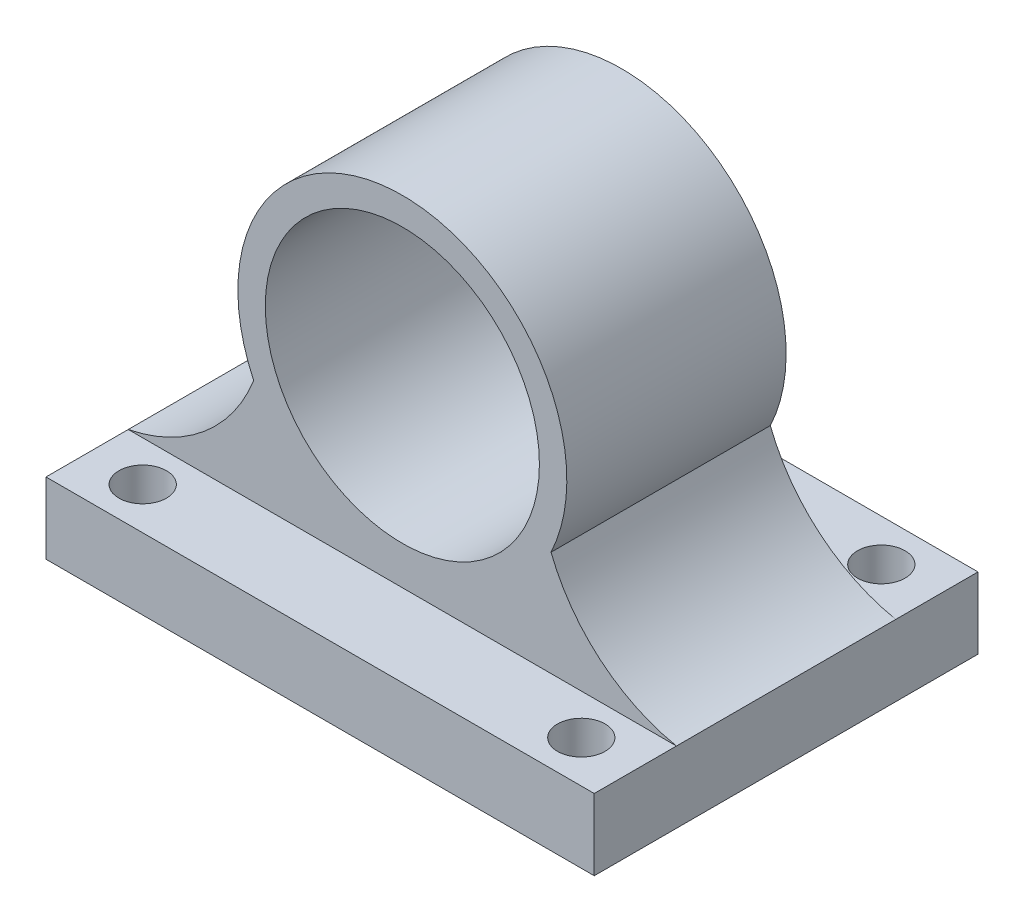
ISO-10303-21;
HEADER;
FILE_DESCRIPTION(('STEP AP214'),'2;1');
FILE_NAME('part.step','',(''),(''),'','','');
FILE_SCHEMA(('AUTOMOTIVE_DESIGN { 1 0 10303 214 1 1 1 1 }'));
ENDSEC;
DATA;
#1=APPLICATION_CONTEXT('core data for automotive mechanical design processes');
#2=APPLICATION_PROTOCOL_DEFINITION('international standard','automotive_design',2000,#1);
#3=PRODUCT_CONTEXT('',#1,'mechanical');
#4=PRODUCT('Part','Part','',(#3));
#5=PRODUCT_RELATED_PRODUCT_CATEGORY('part','',(#4));
#6=PRODUCT_DEFINITION_FORMATION('','',#4);
#7=PRODUCT_DEFINITION_CONTEXT('part definition',#1,'design');
#8=PRODUCT_DEFINITION('design','',#6,#7);
#9=PRODUCT_DEFINITION_SHAPE('','',#8);
#10=(LENGTH_UNIT() NAMED_UNIT(*) SI_UNIT(.MILLI.,.METRE.));
#11=(NAMED_UNIT(*) PLANE_ANGLE_UNIT() SI_UNIT($,.RADIAN.));
#12=(NAMED_UNIT(*) SI_UNIT($,.STERADIAN.) SOLID_ANGLE_UNIT());
#13=UNCERTAINTY_MEASURE_WITH_UNIT(LENGTH_MEASURE(1.E-05),#10,'distance_accuracy_value','');
#14=(GEOMETRIC_REPRESENTATION_CONTEXT(3) GLOBAL_UNCERTAINTY_ASSIGNED_CONTEXT((#13)) GLOBAL_UNIT_ASSIGNED_CONTEXT((#10,
#11,#12)) REPRESENTATION_CONTEXT('',''));
#15=CARTESIAN_POINT('',(0.,0.,0.));
#16=DIRECTION('',(0.,0.,1.));
#17=DIRECTION('',(1.,0.,0.));
#18=AXIS2_PLACEMENT_3D('',#15,#16,#17);
#19=CARTESIAN_POINT('',(31.75,8.255,-22.225));
#20=DIRECTION('',(0.,-1.,0.));
#21=DIRECTION('',(0.,0.,-1.));
#22=AXIS2_PLACEMENT_3D('',#19,#20,#21);
#23=PLANE('',#22);
#24=CARTESIAN_POINT('',(25.4,8.255,17.3736));
#25=DIRECTION('',(0.,-1.,0.));
#26=DIRECTION('',(0.,0.,-1.));
#27=AXIS2_PLACEMENT_3D('',#24,#25,#26);
#28=CIRCLE('',#27,2.7559);
#29=CARTESIAN_POINT('',(25.4,8.255,14.6177));
#30=VERTEX_POINT('',#29);
#31=EDGE_CURVE('E234',#30,#30,#28,.T.);
#32=ORIENTED_EDGE('',*,*,#31,.T.);
#33=EDGE_LOOP('',(#32));
#34=FACE_BOUND('',#33,.T.);
#35=CARTESIAN_POINT('',(-25.4,8.255,17.3736));
#36=DIRECTION('',(0.,-1.,0.));
#37=DIRECTION('',(0.,0.,-1.));
#38=AXIS2_PLACEMENT_3D('',#35,#36,#37);
#39=CIRCLE('',#38,2.7559);
#40=CARTESIAN_POINT('',(-25.4,8.255,14.6177));
#41=VERTEX_POINT('',#40);
#42=EDGE_CURVE('E139',#41,#41,#39,.T.);
#43=ORIENTED_EDGE('',*,*,#42,.T.);
#44=EDGE_LOOP('',(#43));
#45=FACE_BOUND('',#44,.T.);
#46=DIRECTION('',(1.,0.,0.));
#47=VECTOR('',#46,1.);
#48=CARTESIAN_POINT('',(0.,8.255,12.7));
#49=LINE('',#48,#47);
#50=CARTESIAN_POINT('',(-31.75,8.255,12.7));
#51=VERTEX_POINT('',#50);
#52=CARTESIAN_POINT('',(31.75,8.255,12.7));
#53=VERTEX_POINT('',#52);
#54=EDGE_CURVE('E160',#51,#53,#49,.T.);
#55=ORIENTED_EDGE('',*,*,#54,.F.);
#56=DIRECTION('',(0.,0.,1.));
#57=VECTOR('',#56,1.);
#58=CARTESIAN_POINT('',(-31.75,8.255,22.225));
#59=LINE('',#58,#57);
#60=CARTESIAN_POINT('',(-31.75,8.255,22.225));
#61=VERTEX_POINT('',#60);
#62=EDGE_CURVE('E196',#51,#61,#59,.T.);
#63=ORIENTED_EDGE('',*,*,#62,.T.);
#64=DIRECTION('',(1.,0.,0.));
#65=VECTOR('',#64,1.);
#66=CARTESIAN_POINT('',(-31.75,8.255,22.225));
#67=LINE('',#66,#65);
#68=CARTESIAN_POINT('',(31.75,8.255,22.225));
#69=VERTEX_POINT('',#68);
#70=EDGE_CURVE('E58',#61,#69,#67,.T.);
#71=ORIENTED_EDGE('',*,*,#70,.T.);
#72=DIRECTION('',(0.,0.,-1.));
#73=VECTOR('',#72,1.);
#74=CARTESIAN_POINT('',(31.75,8.255,22.225));
#75=LINE('',#74,#73);
#76=EDGE_CURVE('E177',#69,#53,#75,.T.);
#77=ORIENTED_EDGE('',*,*,#76,.T.);
#78=EDGE_LOOP('',(#55,#63,#71,#77));
#79=FACE_BOUND('',#78,.T.);
#80=ADVANCED_FACE('F32',(#34,#45,#79),#23,.F.);
#81=CARTESIAN_POINT('',(31.75,8.255,22.225));
#82=DIRECTION('',(-1.,0.,0.));
#83=DIRECTION('',(0.,0.,1.));
#84=AXIS2_PLACEMENT_3D('',#81,#82,#83);
#85=PLANE('',#84);
#86=DIRECTION('',(0.,0.,-1.));
#87=VECTOR('',#86,1.);
#88=CARTESIAN_POINT('',(31.75,0.,22.225));
#89=LINE('',#88,#87);
#90=CARTESIAN_POINT('',(31.75,0.,22.225));
#91=VERTEX_POINT('',#90);
#92=CARTESIAN_POINT('',(31.75,0.,-22.225));
#93=VERTEX_POINT('',#92);
#94=EDGE_CURVE('E167',#91,#93,#89,.T.);
#95=ORIENTED_EDGE('',*,*,#94,.T.);
#96=DIRECTION('',(0.,-1.,0.));
#97=VECTOR('',#96,1.);
#98=CARTESIAN_POINT('',(31.75,8.255,-22.225));
#99=LINE('',#98,#97);
#100=CARTESIAN_POINT('',(31.75,8.255,-22.225));
#101=VERTEX_POINT('',#100);
#102=EDGE_CURVE('E11',#101,#93,#99,.T.);
#103=ORIENTED_EDGE('',*,*,#102,.F.);
#104=CARTESIAN_POINT('',(31.75,8.255,-12.7));
#105=VERTEX_POINT('',#104);
#106=EDGE_CURVE('E87',#105,#101,#75,.T.);
#107=ORIENTED_EDGE('',*,*,#106,.F.);
#108=DIRECTION('',(0.,0.,1.));
#109=VECTOR('',#108,1.);
#110=CARTESIAN_POINT('',(31.75,8.255,-12.7));
#111=LINE('',#110,#109);
#112=EDGE_CURVE('E149',#105,#53,#111,.T.);
#113=ORIENTED_EDGE('',*,*,#112,.T.);
#114=ORIENTED_EDGE('',*,*,#76,.F.);
#115=DIRECTION('',(0.,-1.,0.));
#116=VECTOR('',#115,1.);
#117=CARTESIAN_POINT('',(31.75,8.255,22.225));
#118=LINE('',#117,#116);
#119=EDGE_CURVE('E183',#69,#91,#118,.T.);
#120=ORIENTED_EDGE('',*,*,#119,.T.);
#121=EDGE_LOOP('',(#95,#103,#107,#113,#114,#120));
#122=FACE_BOUND('',#121,.T.);
#123=ADVANCED_FACE('F34',(#122),#85,.F.);
#124=CARTESIAN_POINT('',(-31.75,8.255,-22.225));
#125=DIRECTION('',(0.,0.,1.));
#126=DIRECTION('',(1.,0.,0.));
#127=AXIS2_PLACEMENT_3D('',#124,#125,#126);
#128=PLANE('',#127);
#129=DIRECTION('',(-1.,0.,0.));
#130=VECTOR('',#129,1.);
#131=CARTESIAN_POINT('',(-31.75,0.,-22.225));
#132=LINE('',#131,#130);
#133=CARTESIAN_POINT('',(-31.75,0.,-22.225));
#134=VERTEX_POINT('',#133);
#135=EDGE_CURVE('E188',#93,#134,#132,.T.);
#136=ORIENTED_EDGE('',*,*,#135,.T.);
#137=DIRECTION('',(0.,-1.,0.));
#138=VECTOR('',#137,1.);
#139=CARTESIAN_POINT('',(-31.75,8.255,-22.225));
#140=LINE('',#139,#138);
#141=CARTESIAN_POINT('',(-31.75,8.255,-22.225));
#142=VERTEX_POINT('',#141);
#143=EDGE_CURVE('E41',#142,#134,#140,.T.);
#144=ORIENTED_EDGE('',*,*,#143,.F.);
#145=DIRECTION('',(-1.,0.,0.));
#146=VECTOR('',#145,1.);
#147=CARTESIAN_POINT('',(-31.75,8.255,-22.225));
#148=LINE('',#147,#146);
#149=EDGE_CURVE('E171',#101,#142,#148,.T.);
#150=ORIENTED_EDGE('',*,*,#149,.F.);
#151=ORIENTED_EDGE('',*,*,#102,.T.);
#152=EDGE_LOOP('',(#136,#144,#150,#151));
#153=FACE_BOUND('',#152,.T.);
#154=ADVANCED_FACE('F206',(#153),#128,.F.);
#155=CARTESIAN_POINT('',(-31.75,8.255,22.225));
#156=DIRECTION('',(1.,0.,0.));
#157=DIRECTION('',(0.,0.,-1.));
#158=AXIS2_PLACEMENT_3D('',#155,#156,#157);
#159=PLANE('',#158);
#160=DIRECTION('',(0.,0.,1.));
#161=VECTOR('',#160,1.);
#162=CARTESIAN_POINT('',(-31.75,0.,22.225));
#163=LINE('',#162,#161);
#164=CARTESIAN_POINT('',(-31.75,0.,22.225));
#165=VERTEX_POINT('',#164);
#166=EDGE_CURVE('E186',#134,#165,#163,.T.);
#167=ORIENTED_EDGE('',*,*,#166,.T.);
#168=DIRECTION('',(0.,-1.,0.));
#169=VECTOR('',#168,1.);
#170=CARTESIAN_POINT('',(-31.75,8.255,22.225));
#171=LINE('',#170,#169);
#172=EDGE_CURVE('E181',#61,#165,#171,.T.);
#173=ORIENTED_EDGE('',*,*,#172,.F.);
#174=ORIENTED_EDGE('',*,*,#62,.F.);
#175=DIRECTION('',(0.,0.,1.));
#176=VECTOR('',#175,1.);
#177=CARTESIAN_POINT('',(-31.75,8.255,-12.7));
#178=LINE('',#177,#176);
#179=CARTESIAN_POINT('',(-31.75,8.255,-12.7));
#180=VERTEX_POINT('',#179);
#181=EDGE_CURVE('E127',#180,#51,#178,.T.);
#182=ORIENTED_EDGE('',*,*,#181,.F.);
#183=EDGE_CURVE('E192',#142,#180,#59,.T.);
#184=ORIENTED_EDGE('',*,*,#183,.F.);
#185=ORIENTED_EDGE('',*,*,#143,.T.);
#186=EDGE_LOOP('',(#167,#173,#174,#182,#184,#185));
#187=FACE_BOUND('',#186,.T.);
#188=ADVANCED_FACE('F209',(#187),#159,.F.);
#189=CARTESIAN_POINT('',(-31.75,8.255,22.225));
#190=DIRECTION('',(0.,0.,-1.));
#191=DIRECTION('',(-1.,0.,0.));
#192=AXIS2_PLACEMENT_3D('',#189,#190,#191);
#193=PLANE('',#192);
#194=DIRECTION('',(1.,0.,0.));
#195=VECTOR('',#194,1.);
#196=CARTESIAN_POINT('',(-31.75,0.,22.225));
#197=LINE('',#196,#195);
#198=EDGE_CURVE('E79',#165,#91,#197,.T.);
#199=ORIENTED_EDGE('',*,*,#198,.T.);
#200=ORIENTED_EDGE('',*,*,#119,.F.);
#201=ORIENTED_EDGE('',*,*,#70,.F.);
#202=ORIENTED_EDGE('',*,*,#172,.T.);
#203=EDGE_LOOP('',(#199,#200,#201,#202));
#204=FACE_BOUND('',#203,.T.);
#205=ADVANCED_FACE('F259',(#204),#193,.F.);
#206=CARTESIAN_POINT('',(25.4,8.255,-17.3736));
#207=DIRECTION('',(0.,-1.,0.));
#208=DIRECTION('',(0.,0.,-1.));
#209=AXIS2_PLACEMENT_3D('',#206,#207,#208);
#210=CIRCLE('',#209,2.7559);
#211=CARTESIAN_POINT('',(25.4,8.255,-20.1295));
#212=VERTEX_POINT('',#211);
#213=EDGE_CURVE('E240',#212,#212,#210,.T.);
#214=ORIENTED_EDGE('',*,*,#213,.T.);
#215=EDGE_LOOP('',(#214));
#216=FACE_BOUND('',#215,.T.);
#217=CARTESIAN_POINT('',(-25.4,8.255,-17.3736));
#218=DIRECTION('',(0.,-1.,0.));
#219=DIRECTION('',(0.,0.,-1.));
#220=AXIS2_PLACEMENT_3D('',#217,#218,#219);
#221=CIRCLE('',#220,2.7559);
#222=CARTESIAN_POINT('',(-25.4,8.255,-20.1295));
#223=VERTEX_POINT('',#222);
#224=EDGE_CURVE('E225',#223,#223,#221,.T.);
#225=ORIENTED_EDGE('',*,*,#224,.T.);
#226=EDGE_LOOP('',(#225));
#227=FACE_BOUND('',#226,.T.);
#228=ORIENTED_EDGE('',*,*,#183,.T.);
#229=DIRECTION('',(1.,0.,0.));
#230=VECTOR('',#229,1.);
#231=CARTESIAN_POINT('',(0.,8.255,-12.7));
#232=LINE('',#231,#230);
#233=EDGE_CURVE('E115',#180,#105,#232,.T.);
#234=ORIENTED_EDGE('',*,*,#233,.T.);
#235=ORIENTED_EDGE('',*,*,#106,.T.);
#236=ORIENTED_EDGE('',*,*,#149,.T.);
#237=EDGE_LOOP('',(#228,#234,#235,#236));
#238=FACE_BOUND('',#237,.T.);
#239=ADVANCED_FACE('F203',(#216,#227,#238),#23,.F.);
#240=CARTESIAN_POINT('',(31.75,0.,-22.225));
#241=DIRECTION('',(0.,-1.,0.));
#242=DIRECTION('',(0.,0.,-1.));
#243=AXIS2_PLACEMENT_3D('',#240,#241,#242);
#244=PLANE('',#243);
#245=CARTESIAN_POINT('',(25.4,0.,-17.3736));
#246=DIRECTION('',(0.,-1.,0.));
#247=DIRECTION('',(0.,0.,-1.));
#248=AXIS2_PLACEMENT_3D('',#245,#246,#247);
#249=CIRCLE('',#248,2.7559);
#250=CARTESIAN_POINT('',(25.4,0.,-20.1295));
#251=VERTEX_POINT('',#250);
#252=EDGE_CURVE('E243',#251,#251,#249,.T.);
#253=ORIENTED_EDGE('',*,*,#252,.F.);
#254=EDGE_LOOP('',(#253));
#255=FACE_BOUND('',#254,.T.);
#256=CARTESIAN_POINT('',(25.4,0.,17.3736));
#257=DIRECTION('',(0.,-1.,0.));
#258=DIRECTION('',(0.,0.,-1.));
#259=AXIS2_PLACEMENT_3D('',#256,#257,#258);
#260=CIRCLE('',#259,2.7559);
#261=CARTESIAN_POINT('',(25.4,0.,14.6177));
#262=VERTEX_POINT('',#261);
#263=EDGE_CURVE('E237',#262,#262,#260,.T.);
#264=ORIENTED_EDGE('',*,*,#263,.F.);
#265=EDGE_LOOP('',(#264));
#266=FACE_BOUND('',#265,.T.);
#267=CARTESIAN_POINT('',(-25.4,0.,-17.3736));
#268=DIRECTION('',(0.,-1.,0.));
#269=DIRECTION('',(0.,0.,-1.));
#270=AXIS2_PLACEMENT_3D('',#267,#268,#269);
#271=CIRCLE('',#270,2.7559);
#272=CARTESIAN_POINT('',(-25.4,0.,-20.1295));
#273=VERTEX_POINT('',#272);
#274=EDGE_CURVE('E229',#273,#273,#271,.T.);
#275=ORIENTED_EDGE('',*,*,#274,.F.);
#276=EDGE_LOOP('',(#275));
#277=FACE_BOUND('',#276,.T.);
#278=CARTESIAN_POINT('',(-25.4,0.,17.3736));
#279=DIRECTION('',(0.,-1.,0.));
#280=DIRECTION('',(0.,0.,-1.));
#281=AXIS2_PLACEMENT_3D('',#278,#279,#280);
#282=CIRCLE('',#281,2.7559);
#283=CARTESIAN_POINT('',(-25.4,0.,14.6177));
#284=VERTEX_POINT('',#283);
#285=EDGE_CURVE('E221',#284,#284,#282,.T.);
#286=ORIENTED_EDGE('',*,*,#285,.F.);
#287=EDGE_LOOP('',(#286));
#288=FACE_BOUND('',#287,.T.);
#289=ORIENTED_EDGE('',*,*,#94,.F.);
#290=ORIENTED_EDGE('',*,*,#198,.F.);
#291=ORIENTED_EDGE('',*,*,#166,.F.);
#292=ORIENTED_EDGE('',*,*,#135,.F.);
#293=EDGE_LOOP('',(#289,#290,#291,#292));
#294=FACE_BOUND('',#293,.T.);
#295=ADVANCED_FACE('F250',(#255,#266,#277,#288,#294),#244,.T.);
#296=CARTESIAN_POINT('',(0.,28.575,-12.7));
#297=DIRECTION('',(0.,0.,1.));
#298=DIRECTION('',(1.,0.,0.));
#299=AXIS2_PLACEMENT_3D('',#296,#297,#298);
#300=CYLINDRICAL_SURFACE('',#299,19.05);
#301=CARTESIAN_POINT('',(0.,28.575,12.7));
#302=DIRECTION('',(0.,0.,1.));
#303=DIRECTION('',(1.,0.,0.));
#304=AXIS2_PLACEMENT_3D('',#301,#302,#303);
#305=CIRCLE('',#304,19.05);
#306=CARTESIAN_POINT('',(17.2205010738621,20.4290290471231,12.7));
#307=VERTEX_POINT('',#306);
#308=CARTESIAN_POINT('',(-17.2205010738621,20.4290290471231,12.7));
#309=VERTEX_POINT('',#308);
#310=EDGE_CURVE('E161',#307,#309,#305,.T.);
#311=ORIENTED_EDGE('',*,*,#310,.F.);
#312=DIRECTION('',(0.,0.,1.));
#313=VECTOR('',#312,1.);
#314=CARTESIAN_POINT('',(17.2205010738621,20.4290290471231,-12.7));
#315=LINE('',#314,#313);
#316=CARTESIAN_POINT('',(17.2205010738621,20.4290290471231,-12.7));
#317=VERTEX_POINT('',#316);
#318=EDGE_CURVE('E131',#317,#307,#315,.T.);
#319=ORIENTED_EDGE('',*,*,#318,.F.);
#320=CARTESIAN_POINT('',(0.,28.575,-12.7));
#321=DIRECTION('',(0.,0.,1.));
#322=DIRECTION('',(1.,0.,0.));
#323=AXIS2_PLACEMENT_3D('',#320,#321,#322);
#324=CIRCLE('',#323,19.05);
#325=CARTESIAN_POINT('',(-17.2205010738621,20.4290290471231,-12.7));
#326=VERTEX_POINT('',#325);
#327=EDGE_CURVE('E114',#317,#326,#324,.T.);
#328=ORIENTED_EDGE('',*,*,#327,.T.);
#329=DIRECTION('',(0.,0.,1.));
#330=VECTOR('',#329,1.);
#331=CARTESIAN_POINT('',(-17.2205010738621,20.4290290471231,-12.7));
#332=LINE('',#331,#330);
#333=EDGE_CURVE('E120',#326,#309,#332,.T.);
#334=ORIENTED_EDGE('',*,*,#333,.T.);
#335=EDGE_LOOP('',(#311,#319,#328,#334));
#336=FACE_BOUND('',#335,.T.);
#337=ADVANCED_FACE('F130',(#336),#300,.T.);
#338=CARTESIAN_POINT('',(35.6032850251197,27.6112017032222,-12.7));
#339=DIRECTION('',(0.,0.,1.));
#340=DIRECTION('',(1.,0.,0.));
#341=AXIS2_PLACEMENT_3D('',#338,#339,#340);
#342=CYLINDRICAL_SURFACE('',#341,19.7360165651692);
#343=CARTESIAN_POINT('',(35.6032850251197,27.6112017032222,12.7));
#344=DIRECTION('',(0.,0.,1.));
#345=DIRECTION('',(1.,0.,0.));
#346=AXIS2_PLACEMENT_3D('',#343,#344,#345);
#347=CIRCLE('',#346,19.7360165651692);
#348=EDGE_CURVE('E135',#53,#307,#347,.F.);
#349=ORIENTED_EDGE('',*,*,#348,.F.);
#350=ORIENTED_EDGE('',*,*,#112,.F.);
#351=CARTESIAN_POINT('',(35.6032850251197,27.6112017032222,-12.7));
#352=DIRECTION('',(0.,0.,1.));
#353=DIRECTION('',(1.,0.,0.));
#354=AXIS2_PLACEMENT_3D('',#351,#352,#353);
#355=CIRCLE('',#354,19.7360165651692);
#356=EDGE_CURVE('E49',#105,#317,#355,.F.);
#357=ORIENTED_EDGE('',*,*,#356,.T.);
#358=ORIENTED_EDGE('',*,*,#318,.T.);
#359=EDGE_LOOP('',(#349,#350,#357,#358));
#360=FACE_BOUND('',#359,.T.);
#361=ADVANCED_FACE('F219',(#360),#342,.F.);
#362=CARTESIAN_POINT('',(-35.6032850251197,27.6112017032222,-12.7));
#363=DIRECTION('',(0.,0.,1.));
#364=DIRECTION('',(1.,0.,0.));
#365=AXIS2_PLACEMENT_3D('',#362,#363,#364);
#366=CYLINDRICAL_SURFACE('',#365,19.7360165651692);
#367=CARTESIAN_POINT('',(-35.6032850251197,27.6112017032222,12.7));
#368=DIRECTION('',(0.,0.,1.));
#369=DIRECTION('',(1.,0.,0.));
#370=AXIS2_PLACEMENT_3D('',#367,#368,#369);
#371=CIRCLE('',#370,19.7360165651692);
#372=EDGE_CURVE('E123',#51,#309,#371,.T.);
#373=ORIENTED_EDGE('',*,*,#372,.T.);
#374=ORIENTED_EDGE('',*,*,#333,.F.);
#375=CARTESIAN_POINT('',(-35.6032850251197,27.6112017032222,-12.7));
#376=DIRECTION('',(0.,0.,1.));
#377=DIRECTION('',(1.,0.,0.));
#378=AXIS2_PLACEMENT_3D('',#375,#376,#377);
#379=CIRCLE('',#378,19.7360165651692);
#380=EDGE_CURVE('E109',#180,#326,#379,.T.);
#381=ORIENTED_EDGE('',*,*,#380,.F.);
#382=ORIENTED_EDGE('',*,*,#181,.T.);
#383=EDGE_LOOP('',(#373,#374,#381,#382));
#384=FACE_BOUND('',#383,.T.);
#385=ADVANCED_FACE('F121',(#384),#366,.F.);
#386=CARTESIAN_POINT('',(0.,28.575,-12.7));
#387=DIRECTION('',(0.,0.,1.));
#388=DIRECTION('',(1.,0.,0.));
#389=AXIS2_PLACEMENT_3D('',#386,#387,#388);
#390=CYLINDRICAL_SURFACE('',#389,15.875);
#391=CARTESIAN_POINT('',(0.,28.575,-12.7));
#392=DIRECTION('',(0.,0.,1.));
#393=DIRECTION('',(1.,0.,0.));
#394=AXIS2_PLACEMENT_3D('',#391,#392,#393);
#395=CIRCLE('',#394,15.875);
#396=CARTESIAN_POINT('',(15.875,28.575,-12.7));
#397=VERTEX_POINT('',#396);
#398=EDGE_CURVE('E128',#397,#397,#395,.T.);
#399=ORIENTED_EDGE('',*,*,#398,.F.);
#400=EDGE_LOOP('',(#399));
#401=FACE_BOUND('',#400,.T.);
#402=CARTESIAN_POINT('',(0.,28.575,12.7));
#403=DIRECTION('',(0.,0.,1.));
#404=DIRECTION('',(1.,0.,0.));
#405=AXIS2_PLACEMENT_3D('',#402,#403,#404);
#406=CIRCLE('',#405,15.875);
#407=CARTESIAN_POINT('',(15.875,28.575,12.7));
#408=VERTEX_POINT('',#407);
#409=EDGE_CURVE('E132',#408,#408,#406,.T.);
#410=ORIENTED_EDGE('',*,*,#409,.T.);
#411=EDGE_LOOP('',(#410));
#412=FACE_BOUND('',#411,.T.);
#413=ADVANCED_FACE('F281',(#401,#412),#390,.F.);
#414=CARTESIAN_POINT('',(0.,-48.6872216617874,-12.7));
#415=DIRECTION('',(0.,0.,1.));
#416=DIRECTION('',(1.,0.,0.));
#417=AXIS2_PLACEMENT_3D('',#414,#415,#416);
#418=PLANE('',#417);
#419=ORIENTED_EDGE('',*,*,#327,.F.);
#420=ORIENTED_EDGE('',*,*,#356,.F.);
#421=ORIENTED_EDGE('',*,*,#233,.F.);
#422=ORIENTED_EDGE('',*,*,#380,.T.);
#423=EDGE_LOOP('',(#419,#420,#421,#422));
#424=FACE_BOUND('',#423,.T.);
#425=ORIENTED_EDGE('',*,*,#398,.T.);
#426=EDGE_LOOP('',(#425));
#427=FACE_BOUND('',#426,.T.);
#428=ADVANCED_FACE('F111',(#424,#427),#418,.F.);
#429=CARTESIAN_POINT('',(0.,-48.6872216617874,12.7));
#430=DIRECTION('',(0.,0.,1.));
#431=DIRECTION('',(1.,0.,0.));
#432=AXIS2_PLACEMENT_3D('',#429,#430,#431);
#433=PLANE('',#432);
#434=ORIENTED_EDGE('',*,*,#310,.T.);
#435=ORIENTED_EDGE('',*,*,#372,.F.);
#436=ORIENTED_EDGE('',*,*,#54,.T.);
#437=ORIENTED_EDGE('',*,*,#348,.T.);
#438=EDGE_LOOP('',(#434,#435,#436,#437));
#439=FACE_BOUND('',#438,.T.);
#440=ORIENTED_EDGE('',*,*,#409,.F.);
#441=EDGE_LOOP('',(#440));
#442=FACE_BOUND('',#441,.T.);
#443=ADVANCED_FACE('F211',(#439,#442),#433,.T.);
#444=CARTESIAN_POINT('',(-25.4,25.4,17.3736));
#445=DIRECTION('',(0.,-1.,0.));
#446=DIRECTION('',(0.,0.,-1.));
#447=AXIS2_PLACEMENT_3D('',#444,#445,#446);
#448=CYLINDRICAL_SURFACE('',#447,2.7559);
#449=ORIENTED_EDGE('',*,*,#285,.T.);
#450=EDGE_LOOP('',(#449));
#451=FACE_BOUND('',#450,.T.);
#452=ORIENTED_EDGE('',*,*,#42,.F.);
#453=EDGE_LOOP('',(#452));
#454=FACE_BOUND('',#453,.T.);
#455=ADVANCED_FACE('F289',(#451,#454),#448,.F.);
#456=CARTESIAN_POINT('',(-25.4,25.4,-17.3736));
#457=DIRECTION('',(0.,-1.,0.));
#458=DIRECTION('',(0.,0.,-1.));
#459=AXIS2_PLACEMENT_3D('',#456,#457,#458);
#460=CYLINDRICAL_SURFACE('',#459,2.7559);
#461=ORIENTED_EDGE('',*,*,#274,.T.);
#462=EDGE_LOOP('',(#461));
#463=FACE_BOUND('',#462,.T.);
#464=ORIENTED_EDGE('',*,*,#224,.F.);
#465=EDGE_LOOP('',(#464));
#466=FACE_BOUND('',#465,.T.);
#467=ADVANCED_FACE('F294',(#463,#466),#460,.F.);
#468=CARTESIAN_POINT('',(25.4,25.4,17.3736));
#469=DIRECTION('',(0.,-1.,0.));
#470=DIRECTION('',(0.,0.,-1.));
#471=AXIS2_PLACEMENT_3D('',#468,#469,#470);
#472=CYLINDRICAL_SURFACE('',#471,2.7559);
#473=ORIENTED_EDGE('',*,*,#263,.T.);
#474=EDGE_LOOP('',(#473));
#475=FACE_BOUND('',#474,.T.);
#476=ORIENTED_EDGE('',*,*,#31,.F.);
#477=EDGE_LOOP('',(#476));
#478=FACE_BOUND('',#477,.T.);
#479=ADVANCED_FACE('F297',(#475,#478),#472,.F.);
#480=CARTESIAN_POINT('',(25.4,25.4,-17.3736));
#481=DIRECTION('',(0.,-1.,0.));
#482=DIRECTION('',(0.,0.,-1.));
#483=AXIS2_PLACEMENT_3D('',#480,#481,#482);
#484=CYLINDRICAL_SURFACE('',#483,2.7559);
#485=ORIENTED_EDGE('',*,*,#252,.T.);
#486=EDGE_LOOP('',(#485));
#487=FACE_BOUND('',#486,.T.);
#488=ORIENTED_EDGE('',*,*,#213,.F.);
#489=EDGE_LOOP('',(#488));
#490=FACE_BOUND('',#489,.T.);
#491=ADVANCED_FACE('F247',(#487,#490),#484,.F.);
#492=CLOSED_SHELL('',(#80,#123,#154,#188,#205,#239,#295,#337,#361,#385,#413,#428,#443,#455,#467,
#479,#491));
#493=MANIFOLD_SOLID_BREP('B2',#492);
#494=ADVANCED_BREP_SHAPE_REPRESENTATION('',(#18,#493),#14);
#495=SHAPE_DEFINITION_REPRESENTATION(#9,#494);
ENDSEC;
END-ISO-10303-21;
